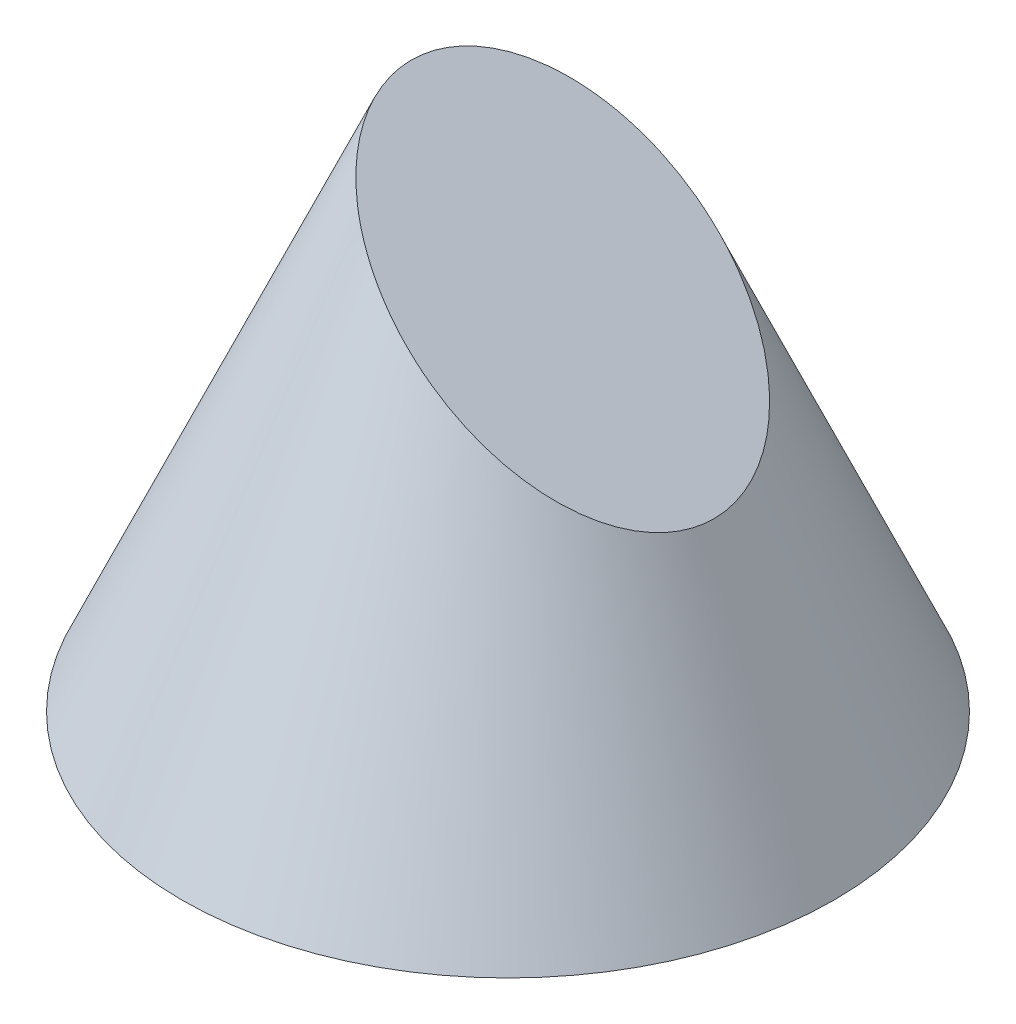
ISO-10303-21;
HEADER;
FILE_DESCRIPTION(('STEP AP214'),'2;1');
FILE_NAME('part.step','',(''),(''),'','','');
FILE_SCHEMA(('AUTOMOTIVE_DESIGN { 1 0 10303 214 1 1 1 1 }'));
ENDSEC;
DATA;
#1=APPLICATION_CONTEXT('core data for automotive mechanical design processes');
#2=APPLICATION_PROTOCOL_DEFINITION('international standard','automotive_design',2000,#1);
#3=PRODUCT_CONTEXT('',#1,'mechanical');
#4=PRODUCT('Part','Part','',(#3));
#5=PRODUCT_RELATED_PRODUCT_CATEGORY('part','',(#4));
#6=PRODUCT_DEFINITION_FORMATION('','',#4);
#7=PRODUCT_DEFINITION_CONTEXT('part definition',#1,'design');
#8=PRODUCT_DEFINITION('design','',#6,#7);
#9=PRODUCT_DEFINITION_SHAPE('','',#8);
#10=(LENGTH_UNIT() NAMED_UNIT(*) SI_UNIT(.MILLI.,.METRE.));
#11=(NAMED_UNIT(*) PLANE_ANGLE_UNIT() SI_UNIT($,.RADIAN.));
#12=(NAMED_UNIT(*) SI_UNIT($,.STERADIAN.) SOLID_ANGLE_UNIT());
#13=UNCERTAINTY_MEASURE_WITH_UNIT(LENGTH_MEASURE(1.E-05),#10,'distance_accuracy_value','');
#14=(GEOMETRIC_REPRESENTATION_CONTEXT(3) GLOBAL_UNCERTAINTY_ASSIGNED_CONTEXT((#13)) GLOBAL_UNIT_ASSIGNED_CONTEXT((#10,
#11,#12)) REPRESENTATION_CONTEXT('',''));
#15=CARTESIAN_POINT('',(0.,0.,0.));
#16=DIRECTION('',(0.,0.,1.));
#17=DIRECTION('',(1.,0.,0.));
#18=AXIS2_PLACEMENT_3D('',#15,#16,#17);
#19=CARTESIAN_POINT('',(0.,0.,0.));
#20=DIRECTION('',(0.,-1.,0.));
#21=DIRECTION('',(0.,0.,1.));
#22=AXIS2_PLACEMENT_3D('',#19,#20,#21);
#23=CONICAL_SURFACE('',#22,18.4677912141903,0.41887902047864);
#24=CARTESIAN_POINT('',(0.,0.,0.));
#25=DIRECTION('',(0.,1.,0.));
#26=DIRECTION('',(0.,0.,1.));
#27=AXIS2_PLACEMENT_3D('',#24,#25,#26);
#28=CIRCLE('',#27,18.4677912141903);
#29=CARTESIAN_POINT('',(0.,0.,18.4677912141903));
#30=VERTEX_POINT('',#29);
#31=EDGE_CURVE('E37',#30,#30,#28,.T.);
#32=ORIENTED_EDGE('',*,*,#31,.T.);
#33=EDGE_LOOP('',(#32));
#34=FACE_BOUND('',#33,.T.);
#35=CARTESIAN_POINT('',(3.09870706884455,22.2439959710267,0.));
#36=DIRECTION('',(0.630672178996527,0.776049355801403,0.));
#37=DIRECTION('',(0.776049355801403,-0.630672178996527,0.));
#38=AXIS2_PLACEMENT_3D('',#35,#36,#37);
#39=ELLIPSE('',#38,11.0355431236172,7.98387568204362);
#40=CARTESIAN_POINT('',(11.6628332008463,15.2841859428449,0.));
#41=VERTEX_POINT('',#40);
#42=EDGE_CURVE('E10',#41,#41,#39,.T.);
#43=ORIENTED_EDGE('',*,*,#42,.F.);
#44=EDGE_LOOP('',(#43));
#45=FACE_BOUND('',#44,.T.);
#46=ADVANCED_FACE('F31',(#34,#45),#23,.T.);
#47=CARTESIAN_POINT('',(0.,0.,0.));
#48=DIRECTION('',(0.,1.,0.));
#49=DIRECTION('',(0.,0.,1.));
#50=AXIS2_PLACEMENT_3D('',#47,#48,#49);
#51=PLANE('',#50);
#52=ORIENTED_EDGE('',*,*,#31,.F.);
#53=EDGE_LOOP('',(#52));
#54=FACE_BOUND('',#53,.T.);
#55=ADVANCED_FACE('F45',(#54),#51,.F.);
#56=CARTESIAN_POINT('',(-7.82151884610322,31.1185380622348,106.460863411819));
#57=DIRECTION('',(0.630672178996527,0.776049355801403,0.));
#58=DIRECTION('',(-0.776049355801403,0.630672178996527,0.));
#59=AXIS2_PLACEMENT_3D('',#56,#57,#58);
#60=PLANE('',#59);
#61=ORIENTED_EDGE('',*,*,#42,.T.);
#62=EDGE_LOOP('',(#61));
#63=FACE_BOUND('',#62,.T.);
#64=ADVANCED_FACE('F47',(#63),#60,.T.);
#65=CLOSED_SHELL('',(#46,#55,#64));
#66=MANIFOLD_SOLID_BREP('B2',#65);
#67=ADVANCED_BREP_SHAPE_REPRESENTATION('',(#18,#66),#14);
#68=SHAPE_DEFINITION_REPRESENTATION(#9,#67);
ENDSEC;
END-ISO-10303-21;
